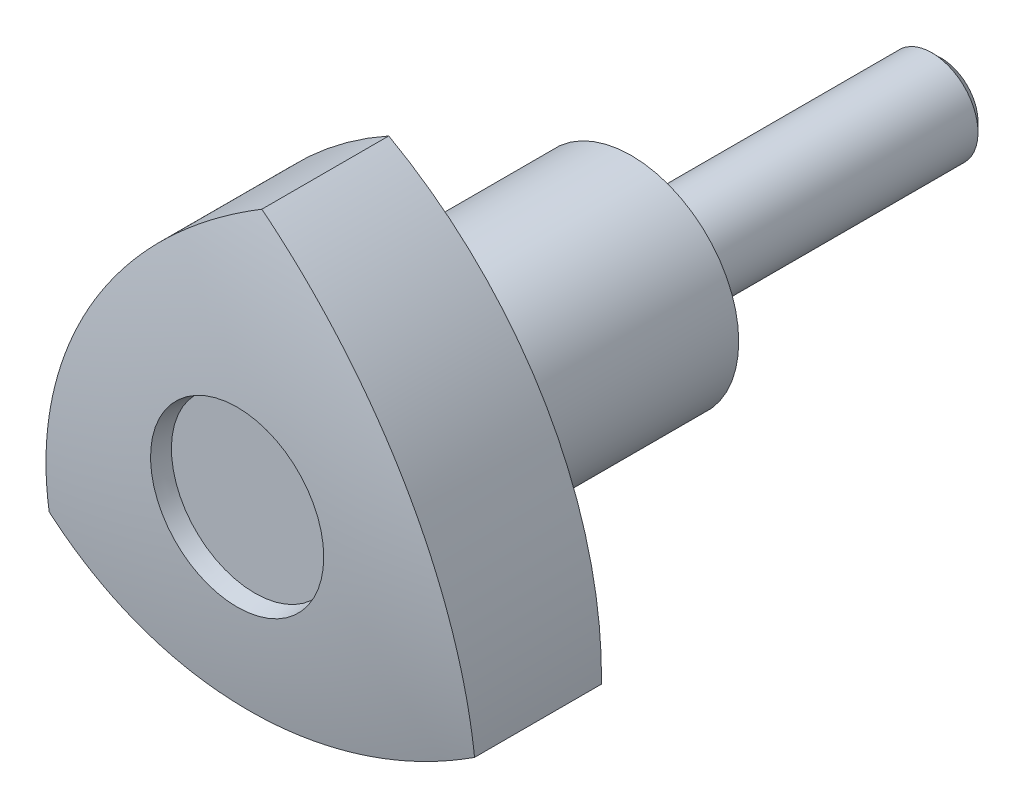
ISO-10303-21;
HEADER;
FILE_DESCRIPTION(('STEP AP214'),'2;1');
FILE_NAME('part.step','',(''),(''),'','','');
FILE_SCHEMA(('AUTOMOTIVE_DESIGN { 1 0 10303 214 1 1 1 1 }'));
ENDSEC;
DATA;
#1=APPLICATION_CONTEXT('core data for automotive mechanical design processes');
#2=APPLICATION_PROTOCOL_DEFINITION('international standard','automotive_design',2000,#1);
#3=PRODUCT_CONTEXT('',#1,'mechanical');
#4=PRODUCT('Part','Part','',(#3));
#5=PRODUCT_RELATED_PRODUCT_CATEGORY('part','',(#4));
#6=PRODUCT_DEFINITION_FORMATION('','',#4);
#7=PRODUCT_DEFINITION_CONTEXT('part definition',#1,'design');
#8=PRODUCT_DEFINITION('design','',#6,#7);
#9=PRODUCT_DEFINITION_SHAPE('','',#8);
#10=(LENGTH_UNIT() NAMED_UNIT(*) SI_UNIT(.MILLI.,.METRE.));
#11=(NAMED_UNIT(*) PLANE_ANGLE_UNIT() SI_UNIT($,.RADIAN.));
#12=(NAMED_UNIT(*) SI_UNIT($,.STERADIAN.) SOLID_ANGLE_UNIT());
#13=UNCERTAINTY_MEASURE_WITH_UNIT(LENGTH_MEASURE(1.E-05),#10,'distance_accuracy_value','');
#14=(GEOMETRIC_REPRESENTATION_CONTEXT(3) GLOBAL_UNCERTAINTY_ASSIGNED_CONTEXT((#13)) GLOBAL_UNIT_ASSIGNED_CONTEXT((#10,
#11,#12)) REPRESENTATION_CONTEXT('',''));
#15=CARTESIAN_POINT('',(0.,0.,0.));
#16=DIRECTION('',(0.,0.,1.));
#17=DIRECTION('',(1.,0.,0.));
#18=AXIS2_PLACEMENT_3D('',#15,#16,#17);
#19=CARTESIAN_POINT('',(0.,-3.9,16.));
#20=DIRECTION('',(0.,0.,-1.));
#21=DIRECTION('',(0.,1.,0.));
#22=AXIS2_PLACEMENT_3D('',#19,#20,#21);
#23=PLANE('',#22);
#24=CARTESIAN_POINT('',(0.,0.,16.0000000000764));
#25=DIRECTION('',(0.,0.,1.));
#26=DIRECTION('',(0.,-1.,0.));
#27=AXIS2_PLACEMENT_3D('',#24,#25,#26);
#28=CIRCLE('',#27,3.90000000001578);
#29=CARTESIAN_POINT('',(0.,-3.90000000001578,16.0000000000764));
#30=VERTEX_POINT('',#29);
#31=EDGE_CURVE('E19',#30,#30,#28,.T.);
#32=ORIENTED_EDGE('',*,*,#31,.T.);
#33=EDGE_LOOP('',(#32));
#34=FACE_BOUND('',#33,.T.);
#35=ADVANCED_FACE('F14',(#34),#23,.F.);
#36=CARTESIAN_POINT('',(0.,0.,23.8666666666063));
#37=DIRECTION('',(0.,0.,1.));
#38=DIRECTION('',(0.,-1.,0.));
#39=AXIS2_PLACEMENT_3D('',#36,#37,#38);
#40=CONICAL_SURFACE('',#39,5.28710558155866,0.17453292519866);
#41=CARTESIAN_POINT('',(0.,0.,23.8666666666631));
#42=DIRECTION('',(0.,0.,1.));
#43=DIRECTION('',(0.,-1.,0.));
#44=AXIS2_PLACEMENT_3D('',#41,#42,#43);
#45=CIRCLE('',#44,5.28710558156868);
#46=CARTESIAN_POINT('',(0.,-5.28710558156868,23.8666666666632));
#47=VERTEX_POINT('',#46);
#48=EDGE_CURVE('E138',#47,#47,#45,.T.);
#49=ORIENTED_EDGE('',*,*,#48,.T.);
#50=EDGE_LOOP('',(#49));
#51=FACE_BOUND('',#50,.T.);
#52=ORIENTED_EDGE('',*,*,#31,.F.);
#53=EDGE_LOOP('',(#52));
#54=FACE_BOUND('',#53,.T.);
#55=ADVANCED_FACE('F146',(#51,#54),#40,.F.);
#56=CARTESIAN_POINT('',(0.,-0.000999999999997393,23.8666666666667));
#57=DIRECTION('',(0.,0.,1.));
#58=DIRECTION('',(0.,-1.,0.));
#59=AXIS2_PLACEMENT_3D('',#56,#57,#58);
#60=PLANE('',#59);
#61=CARTESIAN_POINT('',(0.,0.,23.8666666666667));
#62=DIRECTION('',(0.,0.,-1.));
#63=DIRECTION('',(0.,1.,0.));
#64=AXIS2_PLACEMENT_3D('',#61,#62,#63);
#65=CIRCLE('',#64,0.000999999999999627);
#66=CARTESIAN_POINT('',(0.,0.00100000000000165,23.8666666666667));
#67=VERTEX_POINT('',#66);
#68=EDGE_CURVE('E136',#67,#67,#65,.F.);
#69=ORIENTED_EDGE('',*,*,#68,.T.);
#70=EDGE_LOOP('',(#69));
#71=FACE_BOUND('',#70,.T.);
#72=ORIENTED_EDGE('',*,*,#48,.F.);
#73=EDGE_LOOP('',(#72));
#74=FACE_BOUND('',#73,.T.);
#75=ADVANCED_FACE('F148',(#71,#74),#60,.F.);
#76=CARTESIAN_POINT('',(0.,0.,16.));
#77=DIRECTION('',(0.,0.,-1.));
#78=DIRECTION('',(0.,1.,0.));
#79=AXIS2_PLACEMENT_3D('',#76,#77,#78);
#80=CYLINDRICAL_SURFACE('',#79,0.000999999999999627);
#81=CARTESIAN_POINT('',(0.,0.,24.72));
#82=DIRECTION('',(0.,0.,-1.));
#83=DIRECTION('',(0.,1.,0.));
#84=AXIS2_PLACEMENT_3D('',#81,#82,#83);
#85=CIRCLE('',#84,0.000999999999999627);
#86=CARTESIAN_POINT('',(0.,0.00100000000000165,24.72));
#87=VERTEX_POINT('',#86);
#88=EDGE_CURVE('E133',#87,#87,#85,.F.);
#89=ORIENTED_EDGE('',*,*,#88,.T.);
#90=EDGE_LOOP('',(#89));
#91=FACE_BOUND('',#90,.T.);
#92=ORIENTED_EDGE('',*,*,#68,.F.);
#93=EDGE_LOOP('',(#92));
#94=FACE_BOUND('',#93,.T.);
#95=ADVANCED_FACE('F155',(#91,#94),#80,.F.);
#96=CARTESIAN_POINT('',(0.,0.,-20.));
#97=DIRECTION('',(0.,0.,1.));
#98=DIRECTION('',(0.,-1.,0.));
#99=AXIS2_PLACEMENT_3D('',#96,#97,#98);
#100=PLANE('',#99);
#101=CARTESIAN_POINT('',(0.,0.,-19.9999999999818));
#102=DIRECTION('',(0.,0.,1.));
#103=DIRECTION('',(-1.,0.,0.));
#104=AXIS2_PLACEMENT_3D('',#101,#102,#103);
#105=CIRCLE('',#104,2.38649999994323);
#106=CARTESIAN_POINT('',(-2.38649999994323,0.,-19.9999999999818));
#107=VERTEX_POINT('',#106);
#108=EDGE_CURVE('E130',#107,#107,#105,.T.);
#109=ORIENTED_EDGE('',*,*,#108,.F.);
#110=EDGE_LOOP('',(#109));
#111=FACE_BOUND('',#110,.T.);
#112=ADVANCED_FACE('F211',(#111),#100,.F.);
#113=CARTESIAN_POINT('',(0.,-5.43757127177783,24.72));
#114=DIRECTION('',(0.,0.,-1.));
#115=DIRECTION('',(0.,1.,0.));
#116=AXIS2_PLACEMENT_3D('',#113,#114,#115);
#117=PLANE('',#116);
#118=CARTESIAN_POINT('',(0.,0.,24.720000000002));
#119=DIRECTION('',(0.,0.,1.));
#120=DIRECTION('',(0.,-1.,0.));
#121=AXIS2_PLACEMENT_3D('',#118,#119,#120);
#122=CIRCLE('',#121,5.43757127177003);
#123=CARTESIAN_POINT('',(0.,-5.43757127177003,24.7200000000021));
#124=VERTEX_POINT('',#123);
#125=EDGE_CURVE('E82',#124,#124,#122,.T.);
#126=ORIENTED_EDGE('',*,*,#125,.T.);
#127=EDGE_LOOP('',(#126));
#128=FACE_BOUND('',#127,.T.);
#129=ORIENTED_EDGE('',*,*,#88,.F.);
#130=EDGE_LOOP('',(#129));
#131=FACE_BOUND('',#130,.T.);
#132=ADVANCED_FACE('F207',(#128,#131),#117,.F.);
#133=CARTESIAN_POINT('',(0.,0.,-19.3864999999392));
#134=DIRECTION('',(0.,0.,1.));
#135=DIRECTION('',(-1.,0.,0.));
#136=AXIS2_PLACEMENT_3D('',#133,#134,#135);
#137=CONICAL_SURFACE('',#136,3.00000000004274,0.785398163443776);
#138=ORIENTED_EDGE('',*,*,#108,.T.);
#139=EDGE_LOOP('',(#138));
#140=FACE_BOUND('',#139,.T.);
#141=CARTESIAN_POINT('',(0.,0.,-19.3865));
#142=DIRECTION('',(0.,0.,-1.));
#143=DIRECTION('',(0.,1.,0.));
#144=AXIS2_PLACEMENT_3D('',#141,#142,#143);
#145=CIRCLE('',#144,3.);
#146=CARTESIAN_POINT('',(0.,3.,-19.3865));
#147=VERTEX_POINT('',#146);
#148=EDGE_CURVE('E77',#147,#147,#145,.F.);
#149=ORIENTED_EDGE('',*,*,#148,.F.);
#150=EDGE_LOOP('',(#149));
#151=FACE_BOUND('',#150,.T.);
#152=ADVANCED_FACE('F201',(#140,#151),#137,.T.);
#153=CARTESIAN_POINT('',(0.,0.,25.8766348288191));
#154=DIRECTION('',(0.,0.,1.));
#155=DIRECTION('',(0.,-1.,0.));
#156=AXIS2_PLACEMENT_3D('',#153,#154,#155);
#157=CONICAL_SURFACE('',#156,5.64151719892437,0.174532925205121);
#158=CARTESIAN_POINT('',(0.,0.,25.8766348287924));
#159=DIRECTION('',(0.,0.,-1.));
#160=DIRECTION('',(1.,0.,0.));
#161=AXIS2_PLACEMENT_3D('',#158,#159,#160);
#162=CIRCLE('',#161,5.64151719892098);
#163=CARTESIAN_POINT('',(5.64151719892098,0.,25.8766348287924));
#164=VERTEX_POINT('',#163);
#165=EDGE_CURVE('E74',#164,#164,#162,.T.);
#166=ORIENTED_EDGE('',*,*,#165,.F.);
#167=EDGE_LOOP('',(#166));
#168=FACE_BOUND('',#167,.T.);
#169=ORIENTED_EDGE('',*,*,#125,.F.);
#170=EDGE_LOOP('',(#169));
#171=FACE_BOUND('',#170,.T.);
#172=ADVANCED_FACE('F196',(#168,#171),#157,.F.);
#173=CARTESIAN_POINT('',(0.,0.,16.));
#174=DIRECTION('',(0.,0.,-1.));
#175=DIRECTION('',(0.,1.,0.));
#176=AXIS2_PLACEMENT_3D('',#173,#174,#175);
#177=CYLINDRICAL_SURFACE('',#176,3.);
#178=ORIENTED_EDGE('',*,*,#148,.T.);
#179=EDGE_LOOP('',(#178));
#180=FACE_BOUND('',#179,.T.);
#181=CARTESIAN_POINT('',(0.,0.,0.));
#182=DIRECTION('',(0.,0.,-1.));
#183=DIRECTION('',(0.,1.,0.));
#184=AXIS2_PLACEMENT_3D('',#181,#182,#183);
#185=CIRCLE('',#184,3.);
#186=CARTESIAN_POINT('',(0.,3.,0.));
#187=VERTEX_POINT('',#186);
#188=EDGE_CURVE('E59',#187,#187,#185,.T.);
#189=ORIENTED_EDGE('',*,*,#188,.T.);
#190=EDGE_LOOP('',(#189));
#191=FACE_BOUND('',#190,.T.);
#192=ADVANCED_FACE('F191',(#180,#191),#177,.T.);
#193=CARTESIAN_POINT('',(0.,0.,-34.9694444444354));
#194=DIRECTION('',(0.,0.,1.));
#195=DIRECTION('',(-1.,0.,0.));
#196=AXIS2_PLACEMENT_3D('',#193,#194,#195);
#197=DEGENERATE_TOROIDAL_SURFACE('',#196,1.48886574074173,60.9876206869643,.T.);
#198=ORIENTED_EDGE('',*,*,#165,.T.);
#199=EDGE_LOOP('',(#198));
#200=FACE_BOUND('',#199,.T.);
#201=CARTESIAN_POINT('',(0.,16.,24.2666666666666));
#202=CARTESIAN_POINT('',(0.298468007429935,15.8344141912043,24.3072305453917));
#203=CARTESIAN_POINT('',(0.593899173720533,15.6630883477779,24.3464180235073));
#204=CARTESIAN_POINT('',(1.17828931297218,15.3091538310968,24.4220135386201));
#205=CARTESIAN_POINT('',(1.4672482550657,15.126545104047,24.4584215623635));
#206=CARTESIAN_POINT('',(2.32368013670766,14.5621816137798,24.5634194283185));
#207=CARTESIAN_POINT('',(2.88084921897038,14.1638112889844,24.6278022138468));
#208=CARTESIAN_POINT('',(3.9638795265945,13.3251525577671,24.7451164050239));
#209=CARTESIAN_POINT('',(4.48974088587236,12.8848643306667,24.7980478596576));
#210=CARTESIAN_POINT('',(5.50690924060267,11.964847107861,24.892361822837));
#211=CARTESIAN_POINT('',(5.99821484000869,11.4851165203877,24.9337438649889));
#212=CARTESIAN_POINT('',(6.98285633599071,10.4471495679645,25.007906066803));
#213=CARTESIAN_POINT('',(7.4728924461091,9.88570379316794,25.0396709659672));
#214=CARTESIAN_POINT('',(8.40500958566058,8.72373702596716,25.0895862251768));
#215=CARTESIAN_POINT('',(8.84708705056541,8.12321313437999,25.1077355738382));
#216=CARTESIAN_POINT('',(9.68011063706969,6.8872090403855,25.1304492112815));
#217=CARTESIAN_POINT('',(10.0710498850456,6.25172415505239,25.1350116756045));
#218=CARTESIAN_POINT('',(10.6167727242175,5.27607530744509,25.131672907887));
#219=CARTESIAN_POINT('',(10.7919029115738,4.9471142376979,25.1288627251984));
#220=CARTESIAN_POINT('',(11.1283886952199,4.28215813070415,25.1198463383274));
#221=CARTESIAN_POINT('',(11.2897407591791,3.94616131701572,25.1136392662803));
#222=CARTESIAN_POINT('',(11.750377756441,2.93355634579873,25.0900304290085));
#223=CARTESIAN_POINT('',(12.0289414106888,2.24750521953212,25.0676243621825));
#224=CARTESIAN_POINT('',(12.5284636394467,0.855302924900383,25.0093712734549));
#225=CARTESIAN_POINT('',(12.7494224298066,0.149151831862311,24.9735243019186));
#226=CARTESIAN_POINT('',(13.0365040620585,-0.920875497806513,24.9097113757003));
#227=CARTESIAN_POINT('',(13.1247838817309,-1.279234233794,24.8867756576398));
#228=CARTESIAN_POINT('',(13.2864817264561,-1.99896393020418,24.837568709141));
#229=CARTESIAN_POINT('',(13.3599033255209,-2.36033414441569,24.8112982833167));
#230=CARTESIAN_POINT('',(13.5576933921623,-3.44789900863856,24.727508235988));
#231=CARTESIAN_POINT('',(13.6596925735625,-4.1779413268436,24.6649864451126));
#232=CARTESIAN_POINT('',(13.7820705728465,-5.4245562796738,24.5473880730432));
#233=CARTESIAN_POINT('',(13.8177034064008,-5.94002787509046,24.4956294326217));
#234=CARTESIAN_POINT('',(13.859244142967,-6.97051741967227,24.385838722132));
#235=CARTESIAN_POINT('',(13.8652079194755,-7.48553439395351,24.3278186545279));
#236=CARTESIAN_POINT('',(13.8564064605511,-8.00000000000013,24.2666666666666));
#237=B_SPLINE_CURVE_WITH_KNOTS('',3,(#201,#202,#203,#204,#205,#206,#207,#208,#209,#210,#211,
#212,#213,#214,#215,#216,#217,#218,#219,#220,#221,#222,#223,#224,#225,#226,#227,#228,#229,#230,
#231,#232,#233,#234,#235,#236),.UNSPECIFIED.,.F.,.F.,(4,2,2,2,2,2,2,2,2,2,2,2,2,2,2,2,2,4),(0.,
1.03104347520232,2.06209186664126,4.12370256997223,6.18530445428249,8.24698957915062,
10.481950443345,12.7170773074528,14.9525042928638,16.0702694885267,17.1883203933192,
19.407883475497,21.627438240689,22.7365014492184,23.845297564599,26.0616695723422,
27.6187214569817,29.1728399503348),.UNSPECIFIED.);
#238=CARTESIAN_POINT('',(0.,16.,24.2666666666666));
#239=VERTEX_POINT('',#238);
#240=CARTESIAN_POINT('',(13.856406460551,-8.0000000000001,24.2666666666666));
#241=VERTEX_POINT('',#240);
#242=EDGE_CURVE('E49',#239,#241,#237,.T.);
#243=ORIENTED_EDGE('',*,*,#242,.F.);
#244=CARTESIAN_POINT('',(-13.8564064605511,-7.99999999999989,24.2666666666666));
#245=CARTESIAN_POINT('',(-13.8622389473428,-7.6587262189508,24.3072305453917));
#246=CARTESIAN_POINT('',(-13.861581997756,-7.31721240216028,24.3464180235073));
#247=CARTESIAN_POINT('',(-13.8472607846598,-6.63414843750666,24.4220135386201));
#248=CARTESIAN_POINT('',(-13.8335964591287,-6.29259828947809,24.4584215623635));
#249=CARTESIAN_POINT('',(-13.7730592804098,-5.26872477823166,24.5634194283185));
#250=CARTESIAN_POINT('',(-13.7066450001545,-4.5870170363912,24.6278022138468));
#251=CARTESIAN_POINT('',(-13.5218603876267,-3.22975591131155,24.7451164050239));
#252=CARTESIAN_POINT('',(-13.4034902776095,-2.55420250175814,24.7980478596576));
#253=CARTESIAN_POINT('',(-13.1153161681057,-1.21330025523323,24.892361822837));
#254=CARTESIAN_POINT('',(-12.9455100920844,-0.547951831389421,24.9337438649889));
#255=CARTESIAN_POINT('',(-12.5389250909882,0.823756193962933,25.007906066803));
#256=CARTESIAN_POINT('',(-12.2977168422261,1.52886280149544,25.0396709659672));
#257=CARTESIAN_POINT('',(-11.7574826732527,2.91708330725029,25.0895862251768));
#258=CARTESIAN_POINT('',(-11.4584524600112,3.60019556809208,25.1077355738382));
#259=CARTESIAN_POINT('',(-10.8045533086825,4.93961720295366,25.1304492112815));
#260=CARTESIAN_POINT('',(-10.4496768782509,5.59592296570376,25.1350116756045));
#261=CARTESIAN_POINT('',(-9.87760161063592,6.5563572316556,25.131672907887));
#262=CARTESIAN_POINT('',(-9.68027806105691,6.87250495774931,25.1288627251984));
#263=CARTESIAN_POINT('',(-9.27265207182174,7.49638824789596,25.1198463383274));
#264=CARTESIAN_POINT('',(-9.06234632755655,7.80412164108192,25.1136392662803));
#265=CARTESIAN_POINT('',(-8.41572319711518,8.70934746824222,25.0900304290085));
#266=CARTESIAN_POINT('',(-7.96086732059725,9.29361623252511,25.0676243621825));
#267=CARTESIAN_POINT('',(-7.00494588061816,10.4223163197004,25.0093712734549));
#268=CARTESIAN_POINT('',(-6.50388049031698,10.9667477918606,24.9735243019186));
#269=CARTESIAN_POINT('',(-5.72075045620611,11.7503814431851,24.9097113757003));
#270=CARTESIAN_POINT('',(-5.45454259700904,12.0060133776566,24.8867756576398));
#271=CARTESIAN_POINT('',(-4.91208731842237,12.5059126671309,24.8375687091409));
#272=CARTESIAN_POINT('',(-4.63584233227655,12.7501827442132,24.8112982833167));
#273=CARTESIAN_POINT('',(-3.7928785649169,13.4652563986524,24.727508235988));
#274=CARTESIAN_POINT('',(-3.21164296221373,13.9186114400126,24.6649864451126));
#275=CARTESIAN_POINT('',(-2.19323174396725,14.6479013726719,24.5473880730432));
#276=CARTESIAN_POINT('',(-1.76463666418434,14.9364961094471,24.4956294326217));
#277=CARTESIAN_POINT('',(-0.892976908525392,15.4877162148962,24.385838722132));
#278=CARTESIAN_POINT('',(-0.449941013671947,15.7503894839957,24.3278186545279));
#279=CARTESIAN_POINT('',(0.,16.,24.2666666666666));
#280=B_SPLINE_CURVE_WITH_KNOTS('',3,(#244,#245,#246,#247,#248,#249,#250,#251,#252,#253,#254,
#255,#256,#257,#258,#259,#260,#261,#262,#263,#264,#265,#266,#267,#268,#269,#270,#271,#272,#273,
#274,#275,#276,#277,#278,#279),.UNSPECIFIED.,.F.,.F.,(4,2,2,2,2,2,2,2,2,2,2,2,2,2,2,2,2,4),(0.,
1.03104347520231,2.06209186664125,4.12370256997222,6.18530445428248,8.2469895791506,
10.481950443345,12.7170773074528,14.9525042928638,16.0702694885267,17.1883203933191,
19.407883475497,21.627438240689,22.7365014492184,23.845297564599,26.0616695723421,
27.6187214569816,29.1728399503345),.UNSPECIFIED.);
#281=CARTESIAN_POINT('',(-13.8564064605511,-8.,24.2666666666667));
#282=VERTEX_POINT('',#281);
#283=EDGE_CURVE('E58',#282,#239,#280,.T.);
#284=ORIENTED_EDGE('',*,*,#283,.F.);
#285=CARTESIAN_POINT('',(13.8564064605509,-8.,24.2666666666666));
#286=CARTESIAN_POINT('',(13.5637709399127,-8.17568797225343,24.3072305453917));
#287=CARTESIAN_POINT('',(13.2676828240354,-8.34587594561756,24.3464180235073));
#288=CARTESIAN_POINT('',(12.6689714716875,-8.67500539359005,24.4220135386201));
#289=CARTESIAN_POINT('',(12.3663482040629,-8.83394681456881,24.4584215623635));
#290=CARTESIAN_POINT('',(11.4493791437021,-9.29345683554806,24.5634194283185));
#291=CARTESIAN_POINT('',(10.8257957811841,-9.57679425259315,24.6278022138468));
#292=CARTESIAN_POINT('',(9.55798086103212,-10.0953966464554,24.7451164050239));
#293=CARTESIAN_POINT('',(8.91374939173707,-10.3306618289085,24.7980478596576));
#294=CARTESIAN_POINT('',(7.60840692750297,-10.7515468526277,24.892361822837));
#295=CARTESIAN_POINT('',(6.94729525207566,-10.9371646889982,24.9337438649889));
#296=CARTESIAN_POINT('',(5.55606875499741,-11.2709057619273,25.007906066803));
#297=CARTESIAN_POINT('',(4.82482439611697,-11.4145665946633,25.0396709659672));
#298=CARTESIAN_POINT('',(3.35247308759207,-11.6408203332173,25.0895862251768));
#299=CARTESIAN_POINT('',(2.61136540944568,-11.723408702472,25.1077355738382));
#300=CARTESIAN_POINT('',(1.12444267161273,-11.826826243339,25.1304492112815));
#301=CARTESIAN_POINT('',(0.378626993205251,-11.847647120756,25.1350116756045));
#302=CARTESIAN_POINT('',(-0.739171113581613,-11.8324325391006,25.131672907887));
#303=CARTESIAN_POINT('',(-1.11162485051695,-11.8196191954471,25.1288627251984));
#304=CARTESIAN_POINT('',(-1.85573662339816,-11.7785463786,25.1198463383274));
#305=CARTESIAN_POINT('',(-2.22739443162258,-11.7502829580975,25.1136392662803));
#306=CARTESIAN_POINT('',(-3.33465455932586,-11.6429038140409,25.0900304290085));
#307=CARTESIAN_POINT('',(-4.06807409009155,-11.5411214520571,25.0676243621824));
#308=CARTESIAN_POINT('',(-5.5235177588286,-11.2776192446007,25.0093712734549));
#309=CARTESIAN_POINT('',(-6.24554193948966,-11.1158996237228,24.9735243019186));
#310=CARTESIAN_POINT('',(-7.31575360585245,-10.8295059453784,24.9097113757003));
#311=CARTESIAN_POINT('',(-7.67024128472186,-10.7267791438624,24.8867756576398));
#312=CARTESIAN_POINT('',(-8.37439440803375,-10.5069487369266,24.8375687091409));
#313=CARTESIAN_POINT('',(-8.72406099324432,-10.3898485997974,24.8112982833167));
#314=CARTESIAN_POINT('',(-9.76481482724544,-10.0173573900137,24.727508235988));
#315=CARTESIAN_POINT('',(-10.4480496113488,-9.74067011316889,24.6649864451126));
#316=CARTESIAN_POINT('',(-11.5888388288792,-9.22334509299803,24.5473880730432));
#317=CARTESIAN_POINT('',(-12.0530667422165,-8.9964682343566,24.4956294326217));
#318=CARTESIAN_POINT('',(-12.9662672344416,-8.51719879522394,24.385838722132));
#319=CARTESIAN_POINT('',(-13.4152669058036,-8.26485509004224,24.3278186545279));
#320=CARTESIAN_POINT('',(-13.8564064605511,-8.,24.2666666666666));
#321=B_SPLINE_CURVE_WITH_KNOTS('',3,(#285,#286,#287,#288,#289,#290,#291,#292,#293,#294,#295,
#296,#297,#298,#299,#300,#301,#302,#303,#304,#305,#306,#307,#308,#309,#310,#311,#312,#313,#314,
#315,#316,#317,#318,#319,#320),.UNSPECIFIED.,.F.,.F.,(4,2,2,2,2,2,2,2,2,2,2,2,2,2,2,2,2,4),(0.,
1.03104347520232,2.06209186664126,4.12370256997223,6.18530445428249,8.24698957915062,
10.481950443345,12.7170773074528,14.9525042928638,16.0702694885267,17.1883203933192,
19.407883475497,21.627438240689,22.7365014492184,23.845297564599,26.0616695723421,
27.6187214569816,29.1728399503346),.UNSPECIFIED.);
#322=EDGE_CURVE('E62',#241,#282,#321,.T.);
#323=ORIENTED_EDGE('',*,*,#322,.F.);
#324=EDGE_LOOP('',(#243,#284,#323));
#325=FACE_BOUND('',#324,.T.);
#326=ADVANCED_FACE('F16',(#200,#325),#197,.T.);
#327=CARTESIAN_POINT('',(0.,-3.,0.));
#328=DIRECTION('',(0.,0.,1.));
#329=DIRECTION('',(0.,-1.,0.));
#330=AXIS2_PLACEMENT_3D('',#327,#328,#329);
#331=PLANE('',#330);
#332=ORIENTED_EDGE('',*,*,#188,.F.);
#333=EDGE_LOOP('',(#332));
#334=FACE_BOUND('',#333,.T.);
#335=CARTESIAN_POINT('',(0.,0.,0.));
#336=DIRECTION('',(0.,0.,-1.));
#337=DIRECTION('',(0.,1.,0.));
#338=AXIS2_PLACEMENT_3D('',#335,#336,#337);
#339=CIRCLE('',#338,3.9);
#340=CARTESIAN_POINT('',(0.,3.9,0.));
#341=VERTEX_POINT('',#340);
#342=EDGE_CURVE('E94',#341,#341,#339,.F.);
#343=ORIENTED_EDGE('',*,*,#342,.F.);
#344=EDGE_LOOP('',(#343));
#345=FACE_BOUND('',#344,.T.);
#346=ADVANCED_FACE('F119',(#334,#345),#331,.F.);
#347=CARTESIAN_POINT('',(-13.0596630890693,-7.54,32.));
#348=DIRECTION('',(0.,0.,1.));
#349=DIRECTION('',(-1.,0.,0.));
#350=AXIS2_PLACEMENT_3D('',#347,#348,#349);
#351=CYLINDRICAL_SURFACE('',#350,26.92);
#352=DIRECTION('',(0.,0.,1.));
#353=VECTOR('',#352,1.);
#354=CARTESIAN_POINT('',(13.856406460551,-8.,32.));
#355=LINE('',#354,#353);
#356=CARTESIAN_POINT('',(13.856406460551,-8.,16.));
#357=VERTEX_POINT('',#356);
#358=EDGE_CURVE('E54',#357,#241,#355,.T.);
#359=ORIENTED_EDGE('',*,*,#358,.F.);
#360=CARTESIAN_POINT('',(-13.0596630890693,-7.54,16.));
#361=DIRECTION('',(0.,0.,1.));
#362=DIRECTION('',(-1.,0.,0.));
#363=AXIS2_PLACEMENT_3D('',#360,#361,#362);
#364=CIRCLE('',#363,26.92);
#365=CARTESIAN_POINT('',(0.,16.,16.));
#366=VERTEX_POINT('',#365);
#367=EDGE_CURVE('E92',#357,#366,#364,.T.);
#368=ORIENTED_EDGE('',*,*,#367,.T.);
#369=DIRECTION('',(0.,0.,1.));
#370=VECTOR('',#369,1.);
#371=CARTESIAN_POINT('',(0.,16.,32.));
#372=LINE('',#371,#370);
#373=EDGE_CURVE('E56',#239,#366,#372,.F.);
#374=ORIENTED_EDGE('',*,*,#373,.F.);
#375=ORIENTED_EDGE('',*,*,#242,.T.);
#376=EDGE_LOOP('',(#359,#368,#374,#375));
#377=FACE_BOUND('',#376,.T.);
#378=ADVANCED_FACE('F52',(#377),#351,.T.);
#379=CARTESIAN_POINT('',(13.0596630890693,-7.54,32.));
#380=DIRECTION('',(0.,0.,1.));
#381=DIRECTION('',(-1.,0.,0.));
#382=AXIS2_PLACEMENT_3D('',#379,#380,#381);
#383=CYLINDRICAL_SURFACE('',#382,26.92);
#384=ORIENTED_EDGE('',*,*,#373,.T.);
#385=CARTESIAN_POINT('',(13.0596630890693,-7.54,16.));
#386=DIRECTION('',(0.,0.,1.));
#387=DIRECTION('',(-1.,0.,0.));
#388=AXIS2_PLACEMENT_3D('',#385,#386,#387);
#389=CIRCLE('',#388,26.92);
#390=CARTESIAN_POINT('',(-13.8564064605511,-8.,16.));
#391=VERTEX_POINT('',#390);
#392=EDGE_CURVE('E34',#366,#391,#389,.T.);
#393=ORIENTED_EDGE('',*,*,#392,.T.);
#394=DIRECTION('',(0.,0.,1.));
#395=VECTOR('',#394,1.);
#396=CARTESIAN_POINT('',(-13.8564064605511,-8.,32.));
#397=LINE('',#396,#395);
#398=EDGE_CURVE('E64',#282,#391,#397,.F.);
#399=ORIENTED_EDGE('',*,*,#398,.F.);
#400=ORIENTED_EDGE('',*,*,#283,.T.);
#401=EDGE_LOOP('',(#384,#393,#399,#400));
#402=FACE_BOUND('',#401,.T.);
#403=ADVANCED_FACE('F111',(#402),#383,.T.);
#404=CARTESIAN_POINT('',(0.,15.08,32.));
#405=DIRECTION('',(0.,0.,1.));
#406=DIRECTION('',(-1.,0.,0.));
#407=AXIS2_PLACEMENT_3D('',#404,#405,#406);
#408=CYLINDRICAL_SURFACE('',#407,26.92);
#409=ORIENTED_EDGE('',*,*,#322,.T.);
#410=ORIENTED_EDGE('',*,*,#398,.T.);
#411=CARTESIAN_POINT('',(0.,15.08,16.));
#412=DIRECTION('',(0.,0.,1.));
#413=DIRECTION('',(-1.,0.,0.));
#414=AXIS2_PLACEMENT_3D('',#411,#412,#413);
#415=CIRCLE('',#414,26.92);
#416=EDGE_CURVE('E68',#391,#357,#415,.T.);
#417=ORIENTED_EDGE('',*,*,#416,.T.);
#418=ORIENTED_EDGE('',*,*,#358,.T.);
#419=EDGE_LOOP('',(#409,#410,#417,#418));
#420=FACE_BOUND('',#419,.T.);
#421=ADVANCED_FACE('F66',(#420),#408,.T.);
#422=CARTESIAN_POINT('',(0.,0.,16.));
#423=DIRECTION('',(0.,0.,-1.));
#424=DIRECTION('',(0.,1.,0.));
#425=AXIS2_PLACEMENT_3D('',#422,#423,#424);
#426=CYLINDRICAL_SURFACE('',#425,3.9);
#427=ORIENTED_EDGE('',*,*,#342,.T.);
#428=EDGE_LOOP('',(#427));
#429=FACE_BOUND('',#428,.T.);
#430=CARTESIAN_POINT('',(0.,0.,0.200000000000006));
#431=DIRECTION('',(0.,0.,-1.));
#432=DIRECTION('',(0.,1.,0.));
#433=AXIS2_PLACEMENT_3D('',#430,#431,#432);
#434=CIRCLE('',#433,3.9);
#435=CARTESIAN_POINT('',(0.,3.9,0.200000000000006));
#436=VERTEX_POINT('',#435);
#437=EDGE_CURVE('E87',#436,#436,#434,.T.);
#438=ORIENTED_EDGE('',*,*,#437,.T.);
#439=EDGE_LOOP('',(#438));
#440=FACE_BOUND('',#439,.T.);
#441=ADVANCED_FACE('F110',(#429,#440),#426,.T.);
#442=CARTESIAN_POINT('',(0.,-7.,16.));
#443=DIRECTION('',(0.,0.,1.));
#444=DIRECTION('',(0.,-1.,0.));
#445=AXIS2_PLACEMENT_3D('',#442,#443,#444);
#446=PLANE('',#445);
#447=CARTESIAN_POINT('',(0.,0.,16.));
#448=DIRECTION('',(0.,0.,-1.));
#449=DIRECTION('',(0.,1.,0.));
#450=AXIS2_PLACEMENT_3D('',#447,#448,#449);
#451=CIRCLE('',#450,7.);
#452=CARTESIAN_POINT('',(0.,7.,16.));
#453=VERTEX_POINT('',#452);
#454=EDGE_CURVE('E25',#453,#453,#451,.T.);
#455=ORIENTED_EDGE('',*,*,#454,.F.);
#456=EDGE_LOOP('',(#455));
#457=FACE_BOUND('',#456,.T.);
#458=ORIENTED_EDGE('',*,*,#392,.F.);
#459=ORIENTED_EDGE('',*,*,#367,.F.);
#460=ORIENTED_EDGE('',*,*,#416,.F.);
#461=EDGE_LOOP('',(#458,#459,#460));
#462=FACE_BOUND('',#461,.T.);
#463=ADVANCED_FACE('F166',(#457,#462),#446,.F.);
#464=CARTESIAN_POINT('',(0.,-3.9,0.200000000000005));
#465=DIRECTION('',(0.,0.,1.));
#466=DIRECTION('',(0.,-1.,0.));
#467=AXIS2_PLACEMENT_3D('',#464,#465,#466);
#468=PLANE('',#467);
#469=ORIENTED_EDGE('',*,*,#437,.F.);
#470=EDGE_LOOP('',(#469));
#471=FACE_BOUND('',#470,.T.);
#472=CARTESIAN_POINT('',(0.,0.,0.200000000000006));
#473=DIRECTION('',(0.,0.,-1.));
#474=DIRECTION('',(0.,1.,0.));
#475=AXIS2_PLACEMENT_3D('',#472,#473,#474);
#476=CIRCLE('',#475,7.);
#477=CARTESIAN_POINT('',(0.,7.,0.200000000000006));
#478=VERTEX_POINT('',#477);
#479=EDGE_CURVE('E9',#478,#478,#476,.F.);
#480=ORIENTED_EDGE('',*,*,#479,.F.);
#481=EDGE_LOOP('',(#480));
#482=FACE_BOUND('',#481,.T.);
#483=ADVANCED_FACE('F160',(#471,#482),#468,.F.);
#484=CARTESIAN_POINT('',(0.,0.,16.));
#485=DIRECTION('',(0.,0.,-1.));
#486=DIRECTION('',(0.,1.,0.));
#487=AXIS2_PLACEMENT_3D('',#484,#485,#486);
#488=CYLINDRICAL_SURFACE('',#487,7.);
#489=ORIENTED_EDGE('',*,*,#479,.T.);
#490=EDGE_LOOP('',(#489));
#491=FACE_BOUND('',#490,.T.);
#492=ORIENTED_EDGE('',*,*,#454,.T.);
#493=EDGE_LOOP('',(#492));
#494=FACE_BOUND('',#493,.T.);
#495=ADVANCED_FACE('F158',(#491,#494),#488,.T.);
#496=CLOSED_SHELL('',(#35,#55,#75,#95,#112,#132,#152,#172,#192,#326,#346,#378,#403,#421,#441,
#463,#483,#495));
#497=MANIFOLD_SOLID_BREP('B1',#496);
#498=ADVANCED_BREP_SHAPE_REPRESENTATION('',(#18,#497),#14);
#499=SHAPE_DEFINITION_REPRESENTATION(#9,#498);
ENDSEC;
END-ISO-10303-21;
